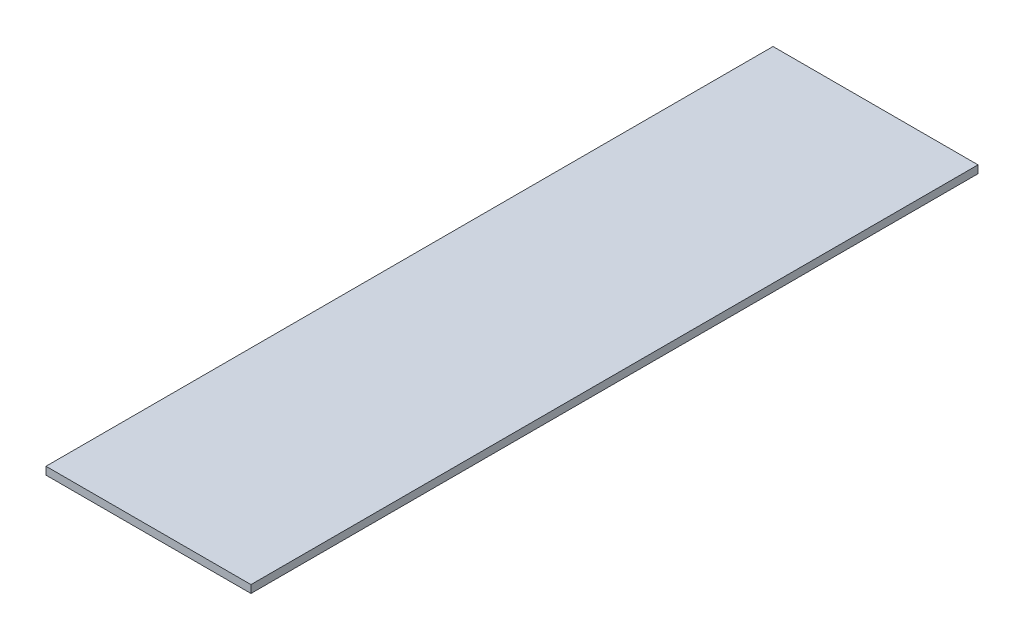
ISO-10303-21;
HEADER;
FILE_DESCRIPTION(('STEP AP214'),'2;1');
FILE_NAME('part.step','',(''),(''),'','','');
FILE_SCHEMA(('AUTOMOTIVE_DESIGN { 1 0 10303 214 1 1 1 1 }'));
ENDSEC;
DATA;
#1=APPLICATION_CONTEXT('core data for automotive mechanical design processes');
#2=APPLICATION_PROTOCOL_DEFINITION('international standard','automotive_design',2000,#1);
#3=PRODUCT_CONTEXT('',#1,'mechanical');
#4=PRODUCT('Part','Part','',(#3));
#5=PRODUCT_RELATED_PRODUCT_CATEGORY('part','',(#4));
#6=PRODUCT_DEFINITION_FORMATION('','',#4);
#7=PRODUCT_DEFINITION_CONTEXT('part definition',#1,'design');
#8=PRODUCT_DEFINITION('design','',#6,#7);
#9=PRODUCT_DEFINITION_SHAPE('','',#8);
#10=(LENGTH_UNIT() NAMED_UNIT(*) SI_UNIT(.MILLI.,.METRE.));
#11=(NAMED_UNIT(*) PLANE_ANGLE_UNIT() SI_UNIT($,.RADIAN.));
#12=(NAMED_UNIT(*) SI_UNIT($,.STERADIAN.) SOLID_ANGLE_UNIT());
#13=UNCERTAINTY_MEASURE_WITH_UNIT(LENGTH_MEASURE(1.E-05),#10,'distance_accuracy_value','');
#14=(GEOMETRIC_REPRESENTATION_CONTEXT(3) GLOBAL_UNCERTAINTY_ASSIGNED_CONTEXT((#13)) GLOBAL_UNIT_ASSIGNED_CONTEXT((#10,
#11,#12)) REPRESENTATION_CONTEXT('',''));
#15=CARTESIAN_POINT('',(0.,0.,0.));
#16=DIRECTION('',(0.,0.,1.));
#17=DIRECTION('',(1.,0.,0.));
#18=AXIS2_PLACEMENT_3D('',#15,#16,#17);
#19=CARTESIAN_POINT('',(265.,-10.,940.));
#20=DIRECTION('',(-1.,0.,0.));
#21=DIRECTION('',(0.,0.,1.));
#22=AXIS2_PLACEMENT_3D('',#19,#20,#21);
#23=PLANE('',#22);
#24=DIRECTION('',(0.,1.,0.));
#25=VECTOR('',#24,1.);
#26=CARTESIAN_POINT('',(265.,-10.,-940.));
#27=LINE('',#26,#25);
#28=CARTESIAN_POINT('',(265.,-10.,-940.));
#29=VERTEX_POINT('',#28);
#30=CARTESIAN_POINT('',(265.,10.,-940.));
#31=VERTEX_POINT('',#30);
#32=EDGE_CURVE('E104',#29,#31,#27,.T.);
#33=ORIENTED_EDGE('',*,*,#32,.T.);
#34=DIRECTION('',(0.,0.,-1.));
#35=VECTOR('',#34,1.);
#36=CARTESIAN_POINT('',(265.,10.,940.));
#37=LINE('',#36,#35);
#38=CARTESIAN_POINT('',(265.,10.,940.));
#39=VERTEX_POINT('',#38);
#40=EDGE_CURVE('E11',#39,#31,#37,.T.);
#41=ORIENTED_EDGE('',*,*,#40,.F.);
#42=DIRECTION('',(0.,1.,0.));
#43=VECTOR('',#42,1.);
#44=CARTESIAN_POINT('',(265.,-10.,940.));
#45=LINE('',#44,#43);
#46=CARTESIAN_POINT('',(265.,-10.,940.));
#47=VERTEX_POINT('',#46);
#48=EDGE_CURVE('E92',#47,#39,#45,.T.);
#49=ORIENTED_EDGE('',*,*,#48,.F.);
#50=DIRECTION('',(0.,0.,-1.));
#51=VECTOR('',#50,1.);
#52=CARTESIAN_POINT('',(265.,-10.,940.));
#53=LINE('',#52,#51);
#54=EDGE_CURVE('E100',#47,#29,#53,.T.);
#55=ORIENTED_EDGE('',*,*,#54,.T.);
#56=EDGE_LOOP('',(#33,#41,#49,#55));
#57=FACE_BOUND('',#56,.T.);
#58=ADVANCED_FACE('F41',(#57),#23,.F.);
#59=CARTESIAN_POINT('',(-265.,10.,940.));
#60=DIRECTION('',(0.,-1.,0.));
#61=DIRECTION('',(0.,0.,-1.));
#62=AXIS2_PLACEMENT_3D('',#59,#60,#61);
#63=PLANE('',#62);
#64=DIRECTION('',(-1.,0.,0.));
#65=VECTOR('',#64,1.);
#66=CARTESIAN_POINT('',(-265.,10.,-940.));
#67=LINE('',#66,#65);
#68=CARTESIAN_POINT('',(-265.,10.,-940.));
#69=VERTEX_POINT('',#68);
#70=EDGE_CURVE('E96',#31,#69,#67,.T.);
#71=ORIENTED_EDGE('',*,*,#70,.T.);
#72=DIRECTION('',(0.,0.,-1.));
#73=VECTOR('',#72,1.);
#74=CARTESIAN_POINT('',(-265.,10.,940.));
#75=LINE('',#74,#73);
#76=CARTESIAN_POINT('',(-265.,10.,940.));
#77=VERTEX_POINT('',#76);
#78=EDGE_CURVE('E49',#77,#69,#75,.T.);
#79=ORIENTED_EDGE('',*,*,#78,.F.);
#80=DIRECTION('',(-1.,0.,0.));
#81=VECTOR('',#80,1.);
#82=CARTESIAN_POINT('',(-265.,10.,940.));
#83=LINE('',#82,#81);
#84=EDGE_CURVE('E87',#39,#77,#83,.T.);
#85=ORIENTED_EDGE('',*,*,#84,.F.);
#86=ORIENTED_EDGE('',*,*,#40,.T.);
#87=EDGE_LOOP('',(#71,#79,#85,#86));
#88=FACE_BOUND('',#87,.T.);
#89=ADVANCED_FACE('F95',(#88),#63,.F.);
#90=CARTESIAN_POINT('',(-265.,-10.,940.));
#91=DIRECTION('',(1.,0.,0.));
#92=DIRECTION('',(0.,0.,-1.));
#93=AXIS2_PLACEMENT_3D('',#90,#91,#92);
#94=PLANE('',#93);
#95=DIRECTION('',(0.,-1.,0.));
#96=VECTOR('',#95,1.);
#97=CARTESIAN_POINT('',(-265.,-10.,-940.));
#98=LINE('',#97,#96);
#99=CARTESIAN_POINT('',(-265.,-10.,-940.));
#100=VERTEX_POINT('',#99);
#101=EDGE_CURVE('E74',#69,#100,#98,.T.);
#102=ORIENTED_EDGE('',*,*,#101,.T.);
#103=DIRECTION('',(0.,0.,-1.));
#104=VECTOR('',#103,1.);
#105=CARTESIAN_POINT('',(-265.,-10.,940.));
#106=LINE('',#105,#104);
#107=CARTESIAN_POINT('',(-265.,-10.,940.));
#108=VERTEX_POINT('',#107);
#109=EDGE_CURVE('E97',#108,#100,#106,.T.);
#110=ORIENTED_EDGE('',*,*,#109,.F.);
#111=DIRECTION('',(0.,-1.,0.));
#112=VECTOR('',#111,1.);
#113=CARTESIAN_POINT('',(-265.,-10.,940.));
#114=LINE('',#113,#112);
#115=EDGE_CURVE('E90',#77,#108,#114,.T.);
#116=ORIENTED_EDGE('',*,*,#115,.F.);
#117=ORIENTED_EDGE('',*,*,#78,.T.);
#118=EDGE_LOOP('',(#102,#110,#116,#117));
#119=FACE_BOUND('',#118,.T.);
#120=ADVANCED_FACE('F98',(#119),#94,.F.);
#121=CARTESIAN_POINT('',(-265.,-10.,940.));
#122=DIRECTION('',(0.,1.,0.));
#123=DIRECTION('',(0.,0.,1.));
#124=AXIS2_PLACEMENT_3D('',#121,#122,#123);
#125=PLANE('',#124);
#126=DIRECTION('',(1.,0.,0.));
#127=VECTOR('',#126,1.);
#128=CARTESIAN_POINT('',(-265.,-10.,-940.));
#129=LINE('',#128,#127);
#130=EDGE_CURVE('E80',#100,#29,#129,.T.);
#131=ORIENTED_EDGE('',*,*,#130,.T.);
#132=ORIENTED_EDGE('',*,*,#54,.F.);
#133=DIRECTION('',(1.,0.,0.));
#134=VECTOR('',#133,1.);
#135=CARTESIAN_POINT('',(-265.,-10.,940.));
#136=LINE('',#135,#134);
#137=EDGE_CURVE('E57',#108,#47,#136,.T.);
#138=ORIENTED_EDGE('',*,*,#137,.F.);
#139=ORIENTED_EDGE('',*,*,#109,.T.);
#140=EDGE_LOOP('',(#131,#132,#138,#139));
#141=FACE_BOUND('',#140,.T.);
#142=ADVANCED_FACE('F111',(#141),#125,.F.);
#143=CARTESIAN_POINT('',(0.,0.,940.));
#144=DIRECTION('',(0.,0.,-1.));
#145=DIRECTION('',(-1.,0.,0.));
#146=AXIS2_PLACEMENT_3D('',#143,#144,#145);
#147=PLANE('',#146);
#148=ORIENTED_EDGE('',*,*,#48,.T.);
#149=ORIENTED_EDGE('',*,*,#84,.T.);
#150=ORIENTED_EDGE('',*,*,#115,.T.);
#151=ORIENTED_EDGE('',*,*,#137,.T.);
#152=EDGE_LOOP('',(#148,#149,#150,#151));
#153=FACE_BOUND('',#152,.T.);
#154=ADVANCED_FACE('F88',(#153),#147,.F.);
#155=CARTESIAN_POINT('',(0.,0.,-940.));
#156=DIRECTION('',(0.,0.,-1.));
#157=DIRECTION('',(-1.,0.,0.));
#158=AXIS2_PLACEMENT_3D('',#155,#156,#157);
#159=PLANE('',#158);
#160=ORIENTED_EDGE('',*,*,#32,.F.);
#161=ORIENTED_EDGE('',*,*,#130,.F.);
#162=ORIENTED_EDGE('',*,*,#101,.F.);
#163=ORIENTED_EDGE('',*,*,#70,.F.);
#164=EDGE_LOOP('',(#160,#161,#162,#163));
#165=FACE_BOUND('',#164,.T.);
#166=ADVANCED_FACE('F114',(#165),#159,.T.);
#167=CLOSED_SHELL('',(#58,#89,#120,#142,#154,#166));
#168=MANIFOLD_SOLID_BREP('B2',#167);
#169=ADVANCED_BREP_SHAPE_REPRESENTATION('',(#18,#168),#14);
#170=SHAPE_DEFINITION_REPRESENTATION(#9,#169);
ENDSEC;
END-ISO-10303-21;
